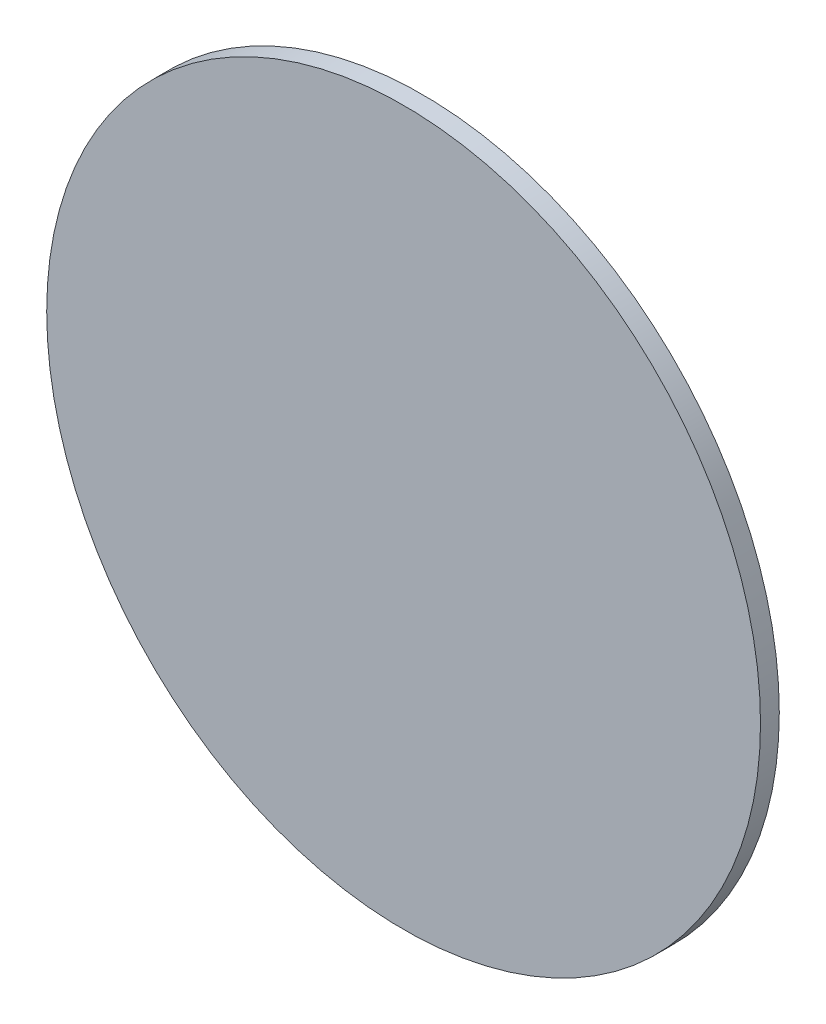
from build123d import *

# Parameters (mm, degrees)
CROQUIS1_R              = 19
SALIENTE_EXTRUIR1_DEPTH = 1


with BuildPart() as part:
    # Croquis1 → Saliente-Extruir1 (new body)
    with BuildSketch(Plane.XY):
        Circle(CROQUIS1_R)
    extrude(amount=SALIENTE_EXTRUIR1_DEPTH)


solid = part.part
